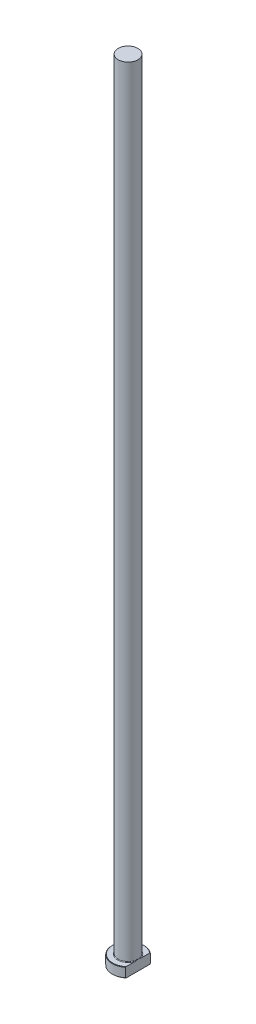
from build123d import *
from build123d.topology import SkipClean

# Parameters (mm, degrees)
CHAMFER1_SIZE = 0.2
FILLET1_R     = 0.3
KEY_DEPTH     = 401.159968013


with BuildPart() as part:
    # Sketch1 → Revolve1 (revolve)
    with BuildSketch(Plane.XY, mode=Mode.PRIVATE) as revolve1_sk:
        Polygon((0, 0), (-8, 0), (-8, 5), (-5, 5), (-5, 400), (0, 400), align=None)
    revolve(revolve1_sk.sketch.rotate(Axis((0, 259.958771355, 0), (0, -1, 0)), 270), axis=Axis((0, 259.958771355, 0), (0, -1, 0)))

    # Chamfer1
    chamfer1_edges = [part.edges().sort_by_distance(p)[0] for p in [
        (0, 5, -8),
        (0, 0, -8),
    ]]
    chamfer(chamfer1_edges, length=CHAMFER1_SIZE)

    # Fillet1
    fillet1_edges = [part.edges().sort_by_distance(p)[0] for p in [
        (0, 5, -5),
    ]]
    fillet(fillet1_edges, radius=FILLET1_R)

    # Sketch2 → KEY (cut, through all)
    with SkipClean():  # the faces are left unmerged after this step: merging them gives an invalid solid
        with BuildSketch(Plane(origin=(0, 0, 0), x_dir=(1, 0, 0), z_dir=(0, 1, 0))):
            with BuildLine():
                Line((5, 6.244997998), (5, -6.244997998))
                ThreePointArc((5, -6.244997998), (8, 0), (5, 6.244997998))
            make_face()
        extrude(amount=KEY_DEPTH, mode=Mode.SUBTRACT)


solid = part.part
